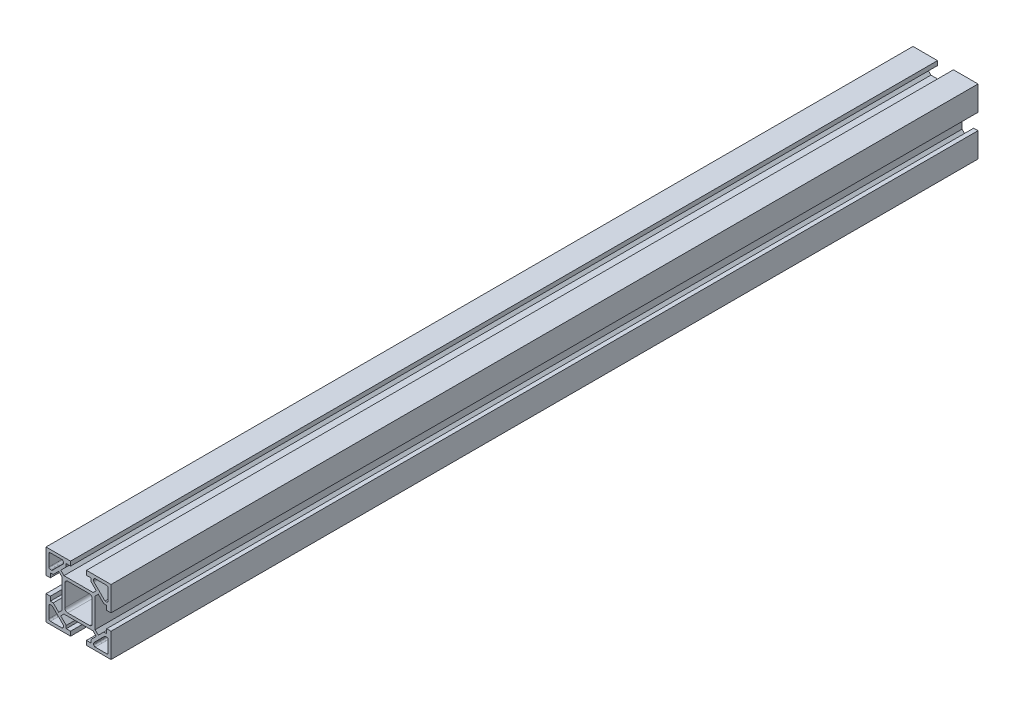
from build123d import *

# Parameters (mm, degrees)
EXTRUSION1_DEPTH        = 600
CONG_1_R                = 1
CONG_2_R                = 2
ESQUISSE2_R             = 5.5
ENL_V_MAT_EXTRU_1_DEPTH = 603.105680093


with BuildPart() as part:
    # Esquisse1 → Extrusion1 (new body)
    with BuildSketch(Plane.XY):
        Polygon((-5.5, 45), (-5.5, 42), (-8.5, 42), (-8.5, 40), (-12.292893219, 36.207106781), (-10.085786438, 34), (10.085786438, 34), (12.292893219, 36.207106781), (8.5, 40), (8.5, 42), (5.5, 42), (5.5, 45), (22.5, 45), (22.5, 28), (19.5, 28), (19.5, 31), (17.5, 31), (13.707106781, 34.792893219), (11.5, 32.585786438), (11.5, 12.414213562), (13.707106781, 10.207106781), (17.5, 14), (19.5, 14), (19.5, 17), (22.5, 17), (22.5, 0), (5.5, 0), (5.5, 3), (8.5, 3), (8.5, 5), (12.292893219, 8.792893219), (10.085786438, 11), (-10.085786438, 11), (-12.292893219, 8.792893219), (-8.5, 5), (-8.5, 3), (-5.5, 3), (-5.5, 0), (-22.5, 0), (-22.5, 17), (-19.5, 17), (-19.5, 14), (-17.5, 14), (-13.707106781, 10.207106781), (-11.5, 12.414213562), (-11.5, 32.585786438), (-13.707106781, 34.792893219), (-17.5, 31), (-19.5, 31), (-19.5, 28), (-22.5, 28), (-22.5, 45), align=None)
        Polygon((-18.328427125, 33), (-10.5, 40.828427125), (-10.5, 43), (-20.5, 43), (-20.5, 33), align=None, mode=Mode.SUBTRACT)
        Polygon((-9.5, 32), (-9.5, 13), (0, 13), (9.5, 13), (9.5, 32), (0, 32), align=None, mode=Mode.SUBTRACT)
        Polygon((18.328427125, 12), (10.5, 4.171572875), (10.5, 2), (20.5, 2), (20.5, 12), align=None, mode=Mode.SUBTRACT)
        Polygon((-10.5, 2), (-10.5, 4.171572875), (-18.328427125, 12), (-20.5, 12), (-20.5, 2), align=None, mode=Mode.SUBTRACT)
        Polygon((10.5, 43), (10.5, 40.828427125), (18.328427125, 33), (20.5, 33), (20.5, 43), align=None, mode=Mode.SUBTRACT)
    extrude(amount=EXTRUSION1_DEPTH)

    # Cong_1
    cong_1_edges = [part.edges().sort_by_distance(p)[0] for p in [
        (20.5, 43, 300),
        (10.5, 43, 300),
        (20.5, 33, 300),
        (10.5, 40.828427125, 300),
        (-20.5, 2, 300),
        (-10.5, 2, 300),
        (-20.5, 12, 300),
        (-18.328427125, 12, 300),
        (-10.5, 4.171572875, 300),
        (20.5, 12, 300),
        (18.328427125, 12, 300),
        (20.5, 2, 300),
        (10.5, 2, 300),
        (10.5, 4.171572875, 300),
        (-20.5, 33, 300),
        (-18.328427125, 33, 300),
        (-20.5, 43, 300),
        (-10.5, 43, 300),
        (-10.5, 40.828427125, 300),
    ]]
    fillet(cong_1_edges, radius=CONG_1_R)

    # Cong_2
    cong_2_edges = [part.edges().sort_by_distance(p)[0] for p in [
        (-9.5, 32, 300),
        (-9.5, 13, 300),
        (9.5, 13, 300),
        (9.5, 32, 300),
    ]]
    fillet(cong_2_edges, radius=CONG_2_R)

    # Esquisse2 → Enl_v. mat.-Extru.1 (cut, through all)
    with BuildSketch(Plane.XZ):
        with Locations((0, 377)):
            Circle(ESQUISSE2_R)
        with Locations((0, 333)):
            Circle(ESQUISSE2_R)
    extrude(amount=-ENL_V_MAT_EXTRU_1_DEPTH, mode=Mode.SUBTRACT)


solid = part.part
